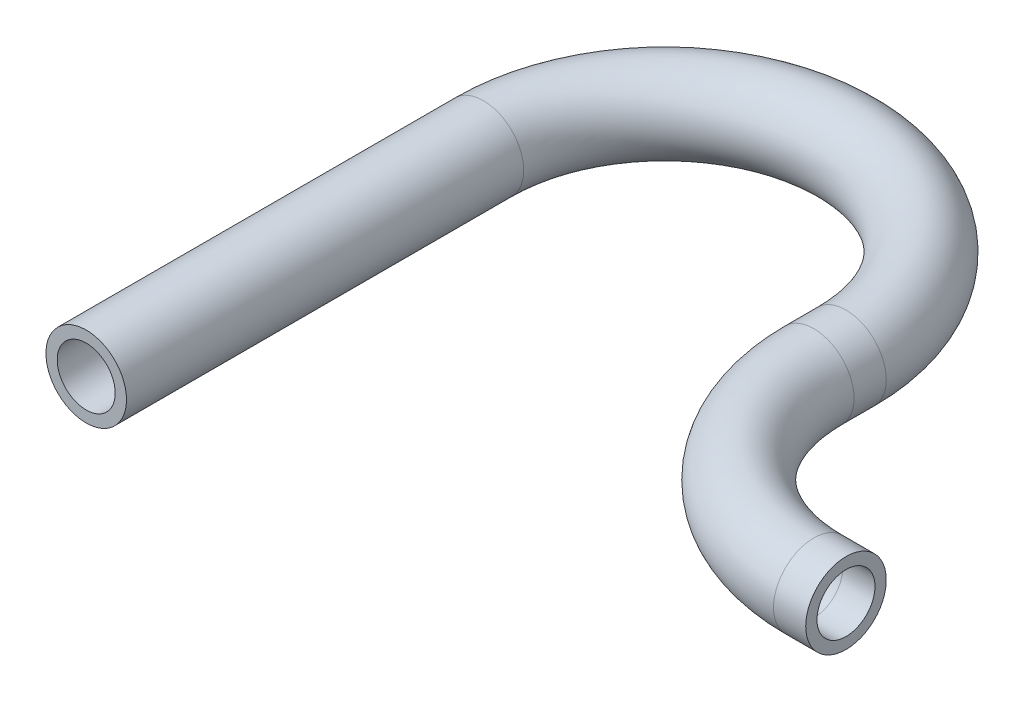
ISO-10303-21;
HEADER;
FILE_DESCRIPTION(('STEP AP214'),'2;1');
FILE_NAME('part.step','',(''),(''),'','','');
FILE_SCHEMA(('AUTOMOTIVE_DESIGN { 1 0 10303 214 1 1 1 1 }'));
ENDSEC;
DATA;
#1=APPLICATION_CONTEXT('core data for automotive mechanical design processes');
#2=APPLICATION_PROTOCOL_DEFINITION('international standard','automotive_design',2000,#1);
#3=PRODUCT_CONTEXT('',#1,'mechanical');
#4=PRODUCT('Part','Part','',(#3));
#5=PRODUCT_RELATED_PRODUCT_CATEGORY('part','',(#4));
#6=PRODUCT_DEFINITION_FORMATION('','',#4);
#7=PRODUCT_DEFINITION_CONTEXT('part definition',#1,'design');
#8=PRODUCT_DEFINITION('design','',#6,#7);
#9=PRODUCT_DEFINITION_SHAPE('','',#8);
#10=(LENGTH_UNIT() NAMED_UNIT(*) SI_UNIT(.MILLI.,.METRE.));
#11=(NAMED_UNIT(*) PLANE_ANGLE_UNIT() SI_UNIT($,.RADIAN.));
#12=(NAMED_UNIT(*) SI_UNIT($,.STERADIAN.) SOLID_ANGLE_UNIT());
#13=UNCERTAINTY_MEASURE_WITH_UNIT(LENGTH_MEASURE(1.E-05),#10,'distance_accuracy_value','');
#14=(GEOMETRIC_REPRESENTATION_CONTEXT(3) GLOBAL_UNCERTAINTY_ASSIGNED_CONTEXT((#13)) GLOBAL_UNIT_ASSIGNED_CONTEXT((#10,
#11,#12)) REPRESENTATION_CONTEXT('',''));
#15=CARTESIAN_POINT('',(0.,0.,0.));
#16=DIRECTION('',(0.,0.,1.));
#17=DIRECTION('',(1.,0.,0.));
#18=AXIS2_PLACEMENT_3D('',#15,#16,#17);
#19=CARTESIAN_POINT('',(42.8625,0.,-14.478));
#20=DIRECTION('',(1.,0.,0.));
#21=DIRECTION('',(0.,0.,-1.));
#22=AXIS2_PLACEMENT_3D('',#19,#20,#21);
#23=CYLINDRICAL_SURFACE('',#22,3.175);
#24=CARTESIAN_POINT('',(42.8625,0.,-14.478));
#25=DIRECTION('',(-1.,0.,0.));
#26=DIRECTION('',(0.,0.,1.));
#27=AXIS2_PLACEMENT_3D('',#24,#25,#26);
#28=CIRCLE('',#27,3.175);
#29=CARTESIAN_POINT('',(42.8625,0.,-11.303));
#30=VERTEX_POINT('',#29);
#31=EDGE_CURVE('E38',#30,#30,#28,.T.);
#32=ORIENTED_EDGE('',*,*,#31,.F.);
#33=EDGE_LOOP('',(#32));
#34=FACE_BOUND('',#33,.T.);
#35=CARTESIAN_POINT('',(45.4025,0.,-14.478));
#36=DIRECTION('',(-1.,0.,0.));
#37=DIRECTION('',(0.,0.,1.));
#38=AXIS2_PLACEMENT_3D('',#35,#36,#37);
#39=CIRCLE('',#38,3.175);
#40=CARTESIAN_POINT('',(45.4025,0.,-11.303));
#41=VERTEX_POINT('',#40);
#42=EDGE_CURVE('E10',#41,#41,#39,.T.);
#43=ORIENTED_EDGE('',*,*,#42,.T.);
#44=EDGE_LOOP('',(#43));
#45=FACE_BOUND('',#44,.T.);
#46=ADVANCED_FACE('F28',(#34,#45),#23,.T.);
#47=CARTESIAN_POINT('',(42.8625,0.,-14.478));
#48=DIRECTION('',(1.,0.,0.));
#49=DIRECTION('',(0.,0.,-1.));
#50=AXIS2_PLACEMENT_3D('',#47,#48,#49);
#51=CYLINDRICAL_SURFACE('',#50,2.286);
#52=CARTESIAN_POINT('',(42.8625,0.,-14.478));
#53=DIRECTION('',(-1.,0.,0.));
#54=DIRECTION('',(0.,0.,1.));
#55=AXIS2_PLACEMENT_3D('',#52,#53,#54);
#56=CIRCLE('',#55,2.286);
#57=CARTESIAN_POINT('',(42.8625,0.,-12.192));
#58=VERTEX_POINT('',#57);
#59=EDGE_CURVE('E42',#58,#58,#56,.T.);
#60=ORIENTED_EDGE('',*,*,#59,.T.);
#61=EDGE_LOOP('',(#60));
#62=FACE_BOUND('',#61,.T.);
#63=CARTESIAN_POINT('',(45.4025,0.,-14.478));
#64=DIRECTION('',(-1.,0.,0.));
#65=DIRECTION('',(0.,0.,1.));
#66=AXIS2_PLACEMENT_3D('',#63,#64,#65);
#67=CIRCLE('',#66,2.286);
#68=CARTESIAN_POINT('',(45.4025,0.,-12.192));
#69=VERTEX_POINT('',#68);
#70=EDGE_CURVE('E34',#69,#69,#67,.T.);
#71=ORIENTED_EDGE('',*,*,#70,.F.);
#72=EDGE_LOOP('',(#71));
#73=FACE_BOUND('',#72,.T.);
#74=ADVANCED_FACE('F97',(#62,#73),#51,.F.);
#75=CARTESIAN_POINT('',(42.8625,0.,-28.7655));
#76=DIRECTION('',(0.,1.,0.));
#77=DIRECTION('',(0.,0.,1.));
#78=AXIS2_PLACEMENT_3D('',#75,#76,#77);
#79=TOROIDAL_SURFACE('',#78,14.2875,3.175);
#80=CARTESIAN_POINT('',(28.575,0.,-28.7655));
#81=DIRECTION('',(0.,0.,-1.));
#82=DIRECTION('',(-1.,0.,0.));
#83=AXIS2_PLACEMENT_3D('',#80,#81,#82);
#84=CIRCLE('',#83,3.175);
#85=CARTESIAN_POINT('',(25.4,0.,-28.7655));
#86=VERTEX_POINT('',#85);
#87=EDGE_CURVE('E47',#86,#86,#84,.T.);
#88=CARTESIAN_POINT('',(42.8625,0.,-28.7655));
#89=DIRECTION('',(0.,1.,0.));
#90=DIRECTION('',(0.,0.,1.));
#91=AXIS2_PLACEMENT_3D('',#88,#89,#90);
#92=CIRCLE('',#91,17.4625);
#93=EDGE_CURVE('',#86,#30,#92,.T.);
#94=ORIENTED_EDGE('',*,*,#87,.F.);
#95=ORIENTED_EDGE('',*,*,#31,.T.);
#96=ORIENTED_EDGE('',*,*,#93,.T.);
#97=ORIENTED_EDGE('',*,*,#93,.F.);
#98=EDGE_LOOP('',(#94,#96,#95,#97));
#99=FACE_BOUND('',#98,.T.);
#100=ADVANCED_FACE('F102',(#99),#79,.T.);
#101=CARTESIAN_POINT('',(42.8625,0.,-28.7655));
#102=DIRECTION('',(0.,1.,0.));
#103=DIRECTION('',(0.,0.,1.));
#104=AXIS2_PLACEMENT_3D('',#101,#102,#103);
#105=TOROIDAL_SURFACE('',#104,14.2875,2.286);
#106=CARTESIAN_POINT('',(28.575,0.,-28.7655));
#107=DIRECTION('',(0.,0.,-1.));
#108=DIRECTION('',(-1.,0.,0.));
#109=AXIS2_PLACEMENT_3D('',#106,#107,#108);
#110=CIRCLE('',#109,2.286);
#111=CARTESIAN_POINT('',(26.289,0.,-28.7655));
#112=VERTEX_POINT('',#111);
#113=EDGE_CURVE('E50',#112,#112,#110,.T.);
#114=CARTESIAN_POINT('',(42.8625,0.,-28.7655));
#115=DIRECTION('',(0.,1.,0.));
#116=DIRECTION('',(0.,0.,1.));
#117=AXIS2_PLACEMENT_3D('',#114,#115,#116);
#118=CIRCLE('',#117,16.5735);
#119=EDGE_CURVE('',#112,#58,#118,.T.);
#120=ORIENTED_EDGE('',*,*,#113,.T.);
#121=ORIENTED_EDGE('',*,*,#59,.F.);
#122=ORIENTED_EDGE('',*,*,#119,.T.);
#123=ORIENTED_EDGE('',*,*,#119,.F.);
#124=EDGE_LOOP('',(#120,#122,#121,#123));
#125=FACE_BOUND('',#124,.T.);
#126=ADVANCED_FACE('F107',(#125),#105,.F.);
#127=CARTESIAN_POINT('',(28.575,0.,-31.3055));
#128=DIRECTION('',(0.,0.,1.));
#129=DIRECTION('',(1.,0.,0.));
#130=AXIS2_PLACEMENT_3D('',#127,#128,#129);
#131=CYLINDRICAL_SURFACE('',#130,3.175);
#132=CARTESIAN_POINT('',(28.575,0.,-31.3055));
#133=DIRECTION('',(0.,0.,-1.));
#134=DIRECTION('',(-1.,0.,0.));
#135=AXIS2_PLACEMENT_3D('',#132,#133,#134);
#136=CIRCLE('',#135,3.175);
#137=CARTESIAN_POINT('',(31.75,0.,-31.3055));
#138=VERTEX_POINT('',#137);
#139=EDGE_CURVE('E53',#138,#138,#136,.T.);
#140=ORIENTED_EDGE('',*,*,#139,.F.);
#141=EDGE_LOOP('',(#140));
#142=FACE_BOUND('',#141,.T.);
#143=ORIENTED_EDGE('',*,*,#87,.T.);
#144=EDGE_LOOP('',(#143));
#145=FACE_BOUND('',#144,.T.);
#146=ADVANCED_FACE('F113',(#142,#145),#131,.T.);
#147=CARTESIAN_POINT('',(28.575,0.,-31.3055));
#148=DIRECTION('',(0.,0.,1.));
#149=DIRECTION('',(1.,0.,0.));
#150=AXIS2_PLACEMENT_3D('',#147,#148,#149);
#151=CYLINDRICAL_SURFACE('',#150,2.286);
#152=CARTESIAN_POINT('',(28.575,0.,-31.3055));
#153=DIRECTION('',(0.,0.,-1.));
#154=DIRECTION('',(-1.,0.,0.));
#155=AXIS2_PLACEMENT_3D('',#152,#153,#154);
#156=CIRCLE('',#155,2.286);
#157=CARTESIAN_POINT('',(30.861,0.,-31.3055));
#158=VERTEX_POINT('',#157);
#159=EDGE_CURVE('E56',#158,#158,#156,.T.);
#160=ORIENTED_EDGE('',*,*,#159,.T.);
#161=EDGE_LOOP('',(#160));
#162=FACE_BOUND('',#161,.T.);
#163=ORIENTED_EDGE('',*,*,#113,.F.);
#164=EDGE_LOOP('',(#163));
#165=FACE_BOUND('',#164,.T.);
#166=ADVANCED_FACE('F120',(#162,#165),#151,.F.);
#167=CARTESIAN_POINT('',(14.2875,0.,-31.3055));
#168=DIRECTION('',(0.,-1.,0.));
#169=DIRECTION('',(0.,0.,-1.));
#170=AXIS2_PLACEMENT_3D('',#167,#168,#169);
#171=TOROIDAL_SURFACE('',#170,14.2875,3.175);
#172=CARTESIAN_POINT('',(0.,0.,-31.3055));
#173=DIRECTION('',(0.,0.,1.));
#174=DIRECTION('',(1.,0.,0.));
#175=AXIS2_PLACEMENT_3D('',#172,#173,#174);
#176=CIRCLE('',#175,3.175);
#177=CARTESIAN_POINT('',(-3.175,0.,-31.3055));
#178=VERTEX_POINT('',#177);
#179=EDGE_CURVE('E59',#178,#178,#176,.T.);
#180=CARTESIAN_POINT('',(14.2875,0.,-31.3055));
#181=DIRECTION('',(0.,-1.,0.));
#182=DIRECTION('',(0.,0.,-1.));
#183=AXIS2_PLACEMENT_3D('',#180,#181,#182);
#184=CIRCLE('',#183,17.4625);
#185=EDGE_CURVE('',#178,#138,#184,.T.);
#186=ORIENTED_EDGE('',*,*,#179,.F.);
#187=ORIENTED_EDGE('',*,*,#139,.T.);
#188=ORIENTED_EDGE('',*,*,#185,.T.);
#189=ORIENTED_EDGE('',*,*,#185,.F.);
#190=EDGE_LOOP('',(#186,#188,#187,#189));
#191=FACE_BOUND('',#190,.T.);
#192=ADVANCED_FACE('F124',(#191),#171,.T.);
#193=CARTESIAN_POINT('',(14.2875,0.,-31.3055));
#194=DIRECTION('',(0.,-1.,0.));
#195=DIRECTION('',(0.,0.,-1.));
#196=AXIS2_PLACEMENT_3D('',#193,#194,#195);
#197=TOROIDAL_SURFACE('',#196,14.2875,2.286);
#198=CARTESIAN_POINT('',(0.,0.,-31.3055));
#199=DIRECTION('',(0.,0.,1.));
#200=DIRECTION('',(1.,0.,0.));
#201=AXIS2_PLACEMENT_3D('',#198,#199,#200);
#202=CIRCLE('',#201,2.286);
#203=CARTESIAN_POINT('',(-2.286,0.,-31.3055));
#204=VERTEX_POINT('',#203);
#205=EDGE_CURVE('E63',#204,#204,#202,.T.);
#206=CARTESIAN_POINT('',(14.2875,0.,-31.3055));
#207=DIRECTION('',(0.,-1.,0.));
#208=DIRECTION('',(0.,0.,-1.));
#209=AXIS2_PLACEMENT_3D('',#206,#207,#208);
#210=CIRCLE('',#209,16.5735);
#211=EDGE_CURVE('',#204,#158,#210,.T.);
#212=ORIENTED_EDGE('',*,*,#205,.T.);
#213=ORIENTED_EDGE('',*,*,#159,.F.);
#214=ORIENTED_EDGE('',*,*,#211,.T.);
#215=ORIENTED_EDGE('',*,*,#211,.F.);
#216=EDGE_LOOP('',(#212,#214,#213,#215));
#217=FACE_BOUND('',#216,.T.);
#218=ADVANCED_FACE('F72',(#217),#197,.F.);
#219=CARTESIAN_POINT('',(0.,0.,-31.3055));
#220=DIRECTION('',(0.,0.,1.));
#221=DIRECTION('',(1.,0.,0.));
#222=AXIS2_PLACEMENT_3D('',#219,#220,#221);
#223=CYLINDRICAL_SURFACE('',#222,2.286);
#224=ORIENTED_EDGE('',*,*,#205,.F.);
#225=EDGE_LOOP('',(#224));
#226=FACE_BOUND('',#225,.T.);
#227=CARTESIAN_POINT('',(0.,0.,0.));
#228=DIRECTION('',(0.,0.,1.));
#229=DIRECTION('',(1.,0.,0.));
#230=AXIS2_PLACEMENT_3D('',#227,#228,#229);
#231=CIRCLE('',#230,2.286);
#232=CARTESIAN_POINT('',(2.286,0.,0.));
#233=VERTEX_POINT('',#232);
#234=EDGE_CURVE('E64',#233,#233,#231,.T.);
#235=ORIENTED_EDGE('',*,*,#234,.T.);
#236=EDGE_LOOP('',(#235));
#237=FACE_BOUND('',#236,.T.);
#238=ADVANCED_FACE('F75',(#226,#237),#223,.F.);
#239=CARTESIAN_POINT('',(0.,0.,-31.3055));
#240=DIRECTION('',(0.,0.,1.));
#241=DIRECTION('',(1.,0.,0.));
#242=AXIS2_PLACEMENT_3D('',#239,#240,#241);
#243=CYLINDRICAL_SURFACE('',#242,3.175);
#244=ORIENTED_EDGE('',*,*,#179,.T.);
#245=EDGE_LOOP('',(#244));
#246=FACE_BOUND('',#245,.T.);
#247=CARTESIAN_POINT('',(0.,0.,0.));
#248=DIRECTION('',(0.,0.,1.));
#249=DIRECTION('',(1.,0.,0.));
#250=AXIS2_PLACEMENT_3D('',#247,#248,#249);
#251=CIRCLE('',#250,3.175);
#252=CARTESIAN_POINT('',(3.175,0.,0.));
#253=VERTEX_POINT('',#252);
#254=EDGE_CURVE('E60',#253,#253,#251,.T.);
#255=ORIENTED_EDGE('',*,*,#254,.F.);
#256=EDGE_LOOP('',(#255));
#257=FACE_BOUND('',#256,.T.);
#258=ADVANCED_FACE('F78',(#246,#257),#243,.T.);
#259=CARTESIAN_POINT('',(45.4025,0.,-14.478));
#260=DIRECTION('',(-1.,0.,0.));
#261=DIRECTION('',(0.,0.,1.));
#262=AXIS2_PLACEMENT_3D('',#259,#260,#261);
#263=PLANE('',#262);
#264=ORIENTED_EDGE('',*,*,#70,.T.);
#265=EDGE_LOOP('',(#264));
#266=FACE_BOUND('',#265,.T.);
#267=ORIENTED_EDGE('',*,*,#42,.F.);
#268=EDGE_LOOP('',(#267));
#269=FACE_BOUND('',#268,.T.);
#270=ADVANCED_FACE('F85',(#266,#269),#263,.F.);
#271=CARTESIAN_POINT('',(0.,0.,0.));
#272=DIRECTION('',(0.,0.,1.));
#273=DIRECTION('',(1.,0.,0.));
#274=AXIS2_PLACEMENT_3D('',#271,#272,#273);
#275=PLANE('',#274);
#276=ORIENTED_EDGE('',*,*,#234,.F.);
#277=EDGE_LOOP('',(#276));
#278=FACE_BOUND('',#277,.T.);
#279=ORIENTED_EDGE('',*,*,#254,.T.);
#280=EDGE_LOOP('',(#279));
#281=FACE_BOUND('',#280,.T.);
#282=ADVANCED_FACE('F82',(#278,#281),#275,.T.);
#283=CLOSED_SHELL('',(#46,#74,#100,#126,#146,#166,#192,#218,#238,#258,#270,#282));
#284=MANIFOLD_SOLID_BREP('B2',#283);
#285=ADVANCED_BREP_SHAPE_REPRESENTATION('',(#18,#284),#14);
#286=SHAPE_DEFINITION_REPRESENTATION(#9,#285);
ENDSEC;
END-ISO-10303-21;
